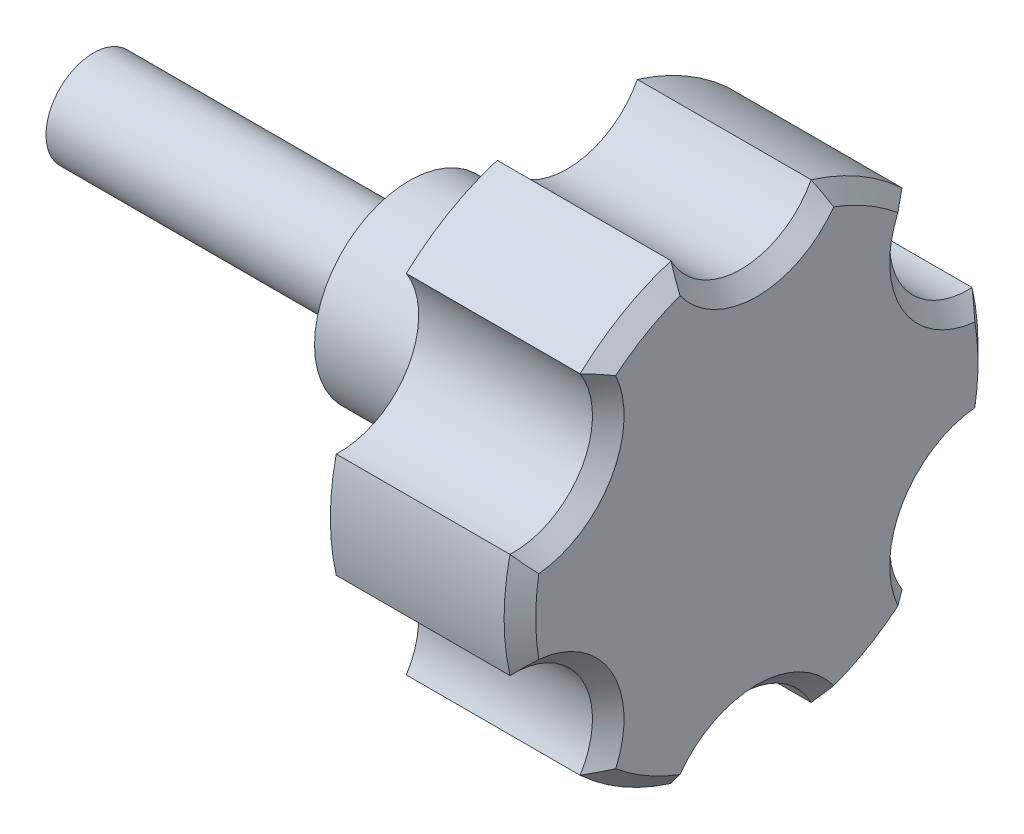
ISO-10303-21;
HEADER;
FILE_DESCRIPTION(('STEP AP214'),'2;1');
FILE_NAME('part.step','',(''),(''),'','','');
FILE_SCHEMA(('AUTOMOTIVE_DESIGN { 1 0 10303 214 1 1 1 1 }'));
ENDSEC;
DATA;
#1=APPLICATION_CONTEXT('core data for automotive mechanical design processes');
#2=APPLICATION_PROTOCOL_DEFINITION('international standard','automotive_design',2000,#1);
#3=PRODUCT_CONTEXT('',#1,'mechanical');
#4=PRODUCT('Part','Part','',(#3));
#5=PRODUCT_RELATED_PRODUCT_CATEGORY('part','',(#4));
#6=PRODUCT_DEFINITION_FORMATION('','',#4);
#7=PRODUCT_DEFINITION_CONTEXT('part definition',#1,'design');
#8=PRODUCT_DEFINITION('design','',#6,#7);
#9=PRODUCT_DEFINITION_SHAPE('','',#8);
#10=(LENGTH_UNIT() NAMED_UNIT(*) SI_UNIT(.MILLI.,.METRE.));
#11=(NAMED_UNIT(*) PLANE_ANGLE_UNIT() SI_UNIT($,.RADIAN.));
#12=(NAMED_UNIT(*) SI_UNIT($,.STERADIAN.) SOLID_ANGLE_UNIT());
#13=UNCERTAINTY_MEASURE_WITH_UNIT(LENGTH_MEASURE(1.E-05),#10,'distance_accuracy_value','');
#14=(GEOMETRIC_REPRESENTATION_CONTEXT(3) GLOBAL_UNCERTAINTY_ASSIGNED_CONTEXT((#13)) GLOBAL_UNIT_ASSIGNED_CONTEXT((#10,
#11,#12)) REPRESENTATION_CONTEXT('',''));
#15=CARTESIAN_POINT('',(0.,0.,0.));
#16=DIRECTION('',(0.,0.,1.));
#17=DIRECTION('',(1.,0.,0.));
#18=AXIS2_PLACEMENT_3D('',#15,#16,#17);
#19=CARTESIAN_POINT('',(-15.9389261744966,0.,0.));
#20=DIRECTION('',(-1.,0.,0.));
#21=DIRECTION('',(0.,0.,1.));
#22=AXIS2_PLACEMENT_3D('',#19,#20,#21);
#23=CYLINDRICAL_SURFACE('',#22,15.);
#24=DIRECTION('',(1.,0.,0.));
#25=VECTOR('',#24,1.);
#26=CARTESIAN_POINT('',(21.,3.32258184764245,-14.627386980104));
#27=LINE('',#26,#25);
#28=CARTESIAN_POINT('',(30.,3.32258184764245,-14.627386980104));
#29=VERTEX_POINT('',#28);
#30=CARTESIAN_POINT('',(41.,3.32258184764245,-14.627386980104));
#31=VERTEX_POINT('',#30);
#32=EDGE_CURVE('E161',#29,#31,#27,.T.);
#33=ORIENTED_EDGE('',*,*,#32,.T.);
#34=CARTESIAN_POINT('',(41.,0.,0.));
#35=DIRECTION('',(-1.,0.,0.));
#36=DIRECTION('',(0.,0.,1.));
#37=AXIS2_PLACEMENT_3D('',#34,#35,#36);
#38=CIRCLE('',#37,15.);
#39=CARTESIAN_POINT('',(41.,-3.32258184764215,-14.6273869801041));
#40=VERTEX_POINT('',#39);
#41=EDGE_CURVE('E11',#31,#40,#38,.T.);
#42=ORIENTED_EDGE('',*,*,#41,.T.);
#43=DIRECTION('',(1.,0.,0.));
#44=VECTOR('',#43,1.);
#45=CARTESIAN_POINT('',(21.,-3.32258184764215,-14.6273869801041));
#46=LINE('',#45,#44);
#47=CARTESIAN_POINT('',(30.,-3.32258184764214,-14.6273869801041));
#48=VERTEX_POINT('',#47);
#49=EDGE_CURVE('E220',#40,#48,#46,.F.);
#50=ORIENTED_EDGE('',*,*,#49,.T.);
#51=CARTESIAN_POINT('',(30.,0.,0.));
#52=DIRECTION('',(-1.,0.,0.));
#53=DIRECTION('',(0.,0.,1.));
#54=AXIS2_PLACEMENT_3D('',#51,#52,#53);
#55=CIRCLE('',#54,15.);
#56=EDGE_CURVE('E172',#29,#48,#55,.T.);
#57=ORIENTED_EDGE('',*,*,#56,.F.);
#58=EDGE_LOOP('',(#33,#42,#50,#57));
#59=FACE_BOUND('',#58,.T.);
#60=ADVANCED_FACE('F28',(#59),#23,.T.);
#61=DIRECTION('',(1.,0.,0.));
#62=VECTOR('',#61,1.);
#63=CARTESIAN_POINT('',(21.,-11.0063977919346,-10.1911337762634));
#64=LINE('',#63,#62);
#65=CARTESIAN_POINT('',(30.,-11.0063977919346,-10.1911337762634));
#66=VERTEX_POINT('',#65);
#67=CARTESIAN_POINT('',(41.,-11.0063977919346,-10.1911337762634));
#68=VERTEX_POINT('',#67);
#69=EDGE_CURVE('E214',#66,#68,#64,.T.);
#70=ORIENTED_EDGE('',*,*,#69,.T.);
#71=CARTESIAN_POINT('',(41.,0.,0.));
#72=DIRECTION('',(-1.,0.,0.));
#73=DIRECTION('',(0.,0.,1.));
#74=AXIS2_PLACEMENT_3D('',#71,#72,#73);
#75=CIRCLE('',#74,15.);
#76=CARTESIAN_POINT('',(41.,-14.328979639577,-4.43625320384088));
#77=VERTEX_POINT('',#76);
#78=EDGE_CURVE('E410',#68,#77,#75,.T.);
#79=ORIENTED_EDGE('',*,*,#78,.T.);
#80=DIRECTION('',(1.,0.,0.));
#81=VECTOR('',#80,1.);
#82=CARTESIAN_POINT('',(21.,-14.328979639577,-4.43625320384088));
#83=LINE('',#82,#81);
#84=CARTESIAN_POINT('',(30.,-14.328979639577,-4.43625320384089));
#85=VERTEX_POINT('',#84);
#86=EDGE_CURVE('E212',#77,#85,#83,.F.);
#87=ORIENTED_EDGE('',*,*,#86,.T.);
#88=EDGE_CURVE('E178',#66,#85,#55,.T.);
#89=ORIENTED_EDGE('',*,*,#88,.F.);
#90=EDGE_LOOP('',(#70,#79,#87,#89));
#91=FACE_BOUND('',#90,.T.);
#92=ADVANCED_FACE('F347',(#91),#23,.T.);
#93=DIRECTION('',(1.,0.,0.));
#94=VECTOR('',#93,1.);
#95=CARTESIAN_POINT('',(21.,-14.328979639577,4.43625320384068));
#96=LINE('',#95,#94);
#97=CARTESIAN_POINT('',(30.,-14.328979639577,4.43625320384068));
#98=VERTEX_POINT('',#97);
#99=CARTESIAN_POINT('',(41.,-14.328979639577,4.43625320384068));
#100=VERTEX_POINT('',#99);
#101=EDGE_CURVE('E206',#98,#100,#96,.T.);
#102=ORIENTED_EDGE('',*,*,#101,.T.);
#103=CARTESIAN_POINT('',(41.,0.,0.));
#104=DIRECTION('',(-1.,0.,0.));
#105=DIRECTION('',(0.,0.,1.));
#106=AXIS2_PLACEMENT_3D('',#103,#104,#105);
#107=CIRCLE('',#106,15.);
#108=CARTESIAN_POINT('',(41.,-11.0063977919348,10.1911337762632));
#109=VERTEX_POINT('',#108);
#110=EDGE_CURVE('E406',#100,#109,#107,.T.);
#111=ORIENTED_EDGE('',*,*,#110,.T.);
#112=DIRECTION('',(1.,0.,0.));
#113=VECTOR('',#112,1.);
#114=CARTESIAN_POINT('',(21.,-11.0063977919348,10.1911337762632));
#115=LINE('',#114,#113);
#116=CARTESIAN_POINT('',(30.,-11.0063977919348,10.1911337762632));
#117=VERTEX_POINT('',#116);
#118=EDGE_CURVE('E204',#109,#117,#115,.F.);
#119=ORIENTED_EDGE('',*,*,#118,.T.);
#120=EDGE_CURVE('E185',#98,#117,#55,.T.);
#121=ORIENTED_EDGE('',*,*,#120,.F.);
#122=EDGE_LOOP('',(#102,#111,#119,#121));
#123=FACE_BOUND('',#122,.T.);
#124=ADVANCED_FACE('F353',(#123),#23,.T.);
#125=DIRECTION('',(1.,0.,0.));
#126=VECTOR('',#125,1.);
#127=CARTESIAN_POINT('',(21.,-3.32258184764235,14.6273869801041));
#128=LINE('',#127,#126);
#129=CARTESIAN_POINT('',(30.,-3.32258184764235,14.6273869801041));
#130=VERTEX_POINT('',#129);
#131=CARTESIAN_POINT('',(41.,-3.32258184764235,14.6273869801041));
#132=VERTEX_POINT('',#131);
#133=EDGE_CURVE('E198',#130,#132,#128,.T.);
#134=ORIENTED_EDGE('',*,*,#133,.T.);
#135=CARTESIAN_POINT('',(41.,0.,0.));
#136=DIRECTION('',(-1.,0.,0.));
#137=DIRECTION('',(0.,0.,1.));
#138=AXIS2_PLACEMENT_3D('',#135,#136,#137);
#139=CIRCLE('',#138,15.);
#140=CARTESIAN_POINT('',(41.,3.32258184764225,14.6273869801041));
#141=VERTEX_POINT('',#140);
#142=EDGE_CURVE('E399',#132,#141,#139,.T.);
#143=ORIENTED_EDGE('',*,*,#142,.T.);
#144=DIRECTION('',(1.,0.,0.));
#145=VECTOR('',#144,1.);
#146=CARTESIAN_POINT('',(21.,3.32258184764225,14.6273869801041));
#147=LINE('',#146,#145);
#148=CARTESIAN_POINT('',(30.,3.32258184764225,14.6273869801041));
#149=VERTEX_POINT('',#148);
#150=EDGE_CURVE('E196',#141,#149,#147,.F.);
#151=ORIENTED_EDGE('',*,*,#150,.T.);
#152=EDGE_CURVE('E180',#130,#149,#55,.T.);
#153=ORIENTED_EDGE('',*,*,#152,.F.);
#154=EDGE_LOOP('',(#134,#143,#151,#153));
#155=FACE_BOUND('',#154,.T.);
#156=ADVANCED_FACE('F369',(#155),#23,.T.);
#157=DIRECTION('',(1.,0.,0.));
#158=VECTOR('',#157,1.);
#159=CARTESIAN_POINT('',(21.,11.0063977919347,10.1911337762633));
#160=LINE('',#159,#158);
#161=CARTESIAN_POINT('',(30.,11.0063977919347,10.1911337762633));
#162=VERTEX_POINT('',#161);
#163=CARTESIAN_POINT('',(41.,11.0063977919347,10.1911337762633));
#164=VERTEX_POINT('',#163);
#165=EDGE_CURVE('E191',#162,#164,#160,.T.);
#166=ORIENTED_EDGE('',*,*,#165,.T.);
#167=CARTESIAN_POINT('',(41.,0.,0.));
#168=DIRECTION('',(-1.,0.,0.));
#169=DIRECTION('',(0.,0.,1.));
#170=AXIS2_PLACEMENT_3D('',#167,#168,#169);
#171=CIRCLE('',#170,15.);
#172=CARTESIAN_POINT('',(41.,14.328979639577,4.43625320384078));
#173=VERTEX_POINT('',#172);
#174=EDGE_CURVE('E380',#164,#173,#171,.T.);
#175=ORIENTED_EDGE('',*,*,#174,.T.);
#176=DIRECTION('',(1.,0.,0.));
#177=VECTOR('',#176,1.);
#178=CARTESIAN_POINT('',(21.,14.328979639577,4.43625320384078));
#179=LINE('',#178,#177);
#180=CARTESIAN_POINT('',(30.,14.328979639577,4.43625320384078));
#181=VERTEX_POINT('',#180);
#182=EDGE_CURVE('E187',#173,#181,#179,.F.);
#183=ORIENTED_EDGE('',*,*,#182,.T.);
#184=EDGE_CURVE('E174',#162,#181,#55,.T.);
#185=ORIENTED_EDGE('',*,*,#184,.F.);
#186=EDGE_LOOP('',(#166,#175,#183,#185));
#187=FACE_BOUND('',#186,.T.);
#188=ADVANCED_FACE('F359',(#187),#23,.T.);
#189=CARTESIAN_POINT('',(0.,0.,0.));
#190=DIRECTION('',(1.,0.,0.));
#191=DIRECTION('',(0.,0.,-1.));
#192=AXIS2_PLACEMENT_3D('',#189,#190,#191);
#193=PLANE('',#192);
#194=CARTESIAN_POINT('',(0.,0.,0.));
#195=DIRECTION('',(-1.,0.,0.));
#196=DIRECTION('',(0.,0.,1.));
#197=AXIS2_PLACEMENT_3D('',#194,#195,#196);
#198=CIRCLE('',#197,3.);
#199=CARTESIAN_POINT('',(0.,0.,3.));
#200=VERTEX_POINT('',#199);
#201=EDGE_CURVE('E439',#200,#200,#198,.T.);
#202=ORIENTED_EDGE('',*,*,#201,.T.);
#203=EDGE_LOOP('',(#202));
#204=FACE_BOUND('',#203,.T.);
#205=ADVANCED_FACE('F30',(#204),#193,.F.);
#206=CARTESIAN_POINT('',(-15.9389261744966,0.,0.));
#207=DIRECTION('',(-1.,0.,0.));
#208=DIRECTION('',(0.,0.,1.));
#209=AXIS2_PLACEMENT_3D('',#206,#207,#208);
#210=CYLINDRICAL_SURFACE('',#209,3.);
#211=ORIENTED_EDGE('',*,*,#201,.F.);
#212=EDGE_LOOP('',(#211));
#213=FACE_BOUND('',#212,.T.);
#214=CARTESIAN_POINT('',(20.,0.,0.));
#215=DIRECTION('',(-1.,0.,0.));
#216=DIRECTION('',(0.,0.,1.));
#217=AXIS2_PLACEMENT_3D('',#214,#215,#216);
#218=CIRCLE('',#217,3.);
#219=CARTESIAN_POINT('',(20.,0.,3.));
#220=VERTEX_POINT('',#219);
#221=EDGE_CURVE('E442',#220,#220,#218,.T.);
#222=ORIENTED_EDGE('',*,*,#221,.T.);
#223=EDGE_LOOP('',(#222));
#224=FACE_BOUND('',#223,.T.);
#225=ADVANCED_FACE('F375',(#213,#224),#210,.T.);
#226=CARTESIAN_POINT('',(20.,3.,0.));
#227=DIRECTION('',(1.,0.,0.));
#228=DIRECTION('',(0.,0.,-1.));
#229=AXIS2_PLACEMENT_3D('',#226,#227,#228);
#230=PLANE('',#229);
#231=ORIENTED_EDGE('',*,*,#221,.F.);
#232=EDGE_LOOP('',(#231));
#233=FACE_BOUND('',#232,.T.);
#234=CARTESIAN_POINT('',(20.,0.,0.));
#235=DIRECTION('',(-1.,0.,0.));
#236=DIRECTION('',(0.,0.,1.));
#237=AXIS2_PLACEMENT_3D('',#234,#235,#236);
#238=CIRCLE('',#237,6.);
#239=CARTESIAN_POINT('',(20.,0.,6.));
#240=VERTEX_POINT('',#239);
#241=EDGE_CURVE('E176',#240,#240,#238,.T.);
#242=ORIENTED_EDGE('',*,*,#241,.T.);
#243=EDGE_LOOP('',(#242));
#244=FACE_BOUND('',#243,.T.);
#245=ADVANCED_FACE('F448',(#233,#244),#230,.F.);
#246=CARTESIAN_POINT('',(-15.9389261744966,0.,0.));
#247=DIRECTION('',(-1.,0.,0.));
#248=DIRECTION('',(0.,0.,1.));
#249=AXIS2_PLACEMENT_3D('',#246,#247,#248);
#250=CYLINDRICAL_SURFACE('',#249,6.);
#251=ORIENTED_EDGE('',*,*,#241,.F.);
#252=EDGE_LOOP('',(#251));
#253=FACE_BOUND('',#252,.T.);
#254=CARTESIAN_POINT('',(30.,0.,0.));
#255=DIRECTION('',(-1.,0.,0.));
#256=DIRECTION('',(0.,0.,1.));
#257=AXIS2_PLACEMENT_3D('',#254,#255,#256);
#258=CIRCLE('',#257,6.);
#259=CARTESIAN_POINT('',(30.,0.,6.));
#260=VERTEX_POINT('',#259);
#261=EDGE_CURVE('E171',#260,#260,#258,.T.);
#262=ORIENTED_EDGE('',*,*,#261,.T.);
#263=EDGE_LOOP('',(#262));
#264=FACE_BOUND('',#263,.T.);
#265=ADVANCED_FACE('F366',(#253,#264),#250,.T.);
#266=CARTESIAN_POINT('',(30.,6.,0.));
#267=DIRECTION('',(1.,0.,0.));
#268=DIRECTION('',(0.,0.,-1.));
#269=AXIS2_PLACEMENT_3D('',#266,#267,#268);
#270=PLANE('',#269);
#271=ORIENTED_EDGE('',*,*,#261,.F.);
#272=EDGE_LOOP('',(#271));
#273=FACE_BOUND('',#272,.T.);
#274=CARTESIAN_POINT('',(30.,14.328979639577,-4.43625320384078));
#275=VERTEX_POINT('',#274);
#276=CARTESIAN_POINT('',(30.,11.0063977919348,-10.1911337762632));
#277=VERTEX_POINT('',#276);
#278=EDGE_CURVE('E154',#275,#277,#55,.T.);
#279=ORIENTED_EDGE('',*,*,#278,.T.);
#280=CARTESIAN_POINT('',(30.,8.31770895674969,-14.4066945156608));
#281=DIRECTION('',(1.,0.,0.));
#282=DIRECTION('',(0.,0.,-1.));
#283=AXIS2_PLACEMENT_3D('',#280,#281,#282);
#284=CIRCLE('',#283,5.);
#285=EDGE_CURVE('E156',#277,#29,#284,.T.);
#286=ORIENTED_EDGE('',*,*,#285,.T.);
#287=ORIENTED_EDGE('',*,*,#56,.T.);
#288=CARTESIAN_POINT('',(30.,-8.31770895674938,-14.406694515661));
#289=DIRECTION('',(1.,0.,0.));
#290=DIRECTION('',(0.,0.,-1.));
#291=AXIS2_PLACEMENT_3D('',#288,#289,#290);
#292=CIRCLE('',#291,5.);
#293=EDGE_CURVE('E217',#48,#66,#292,.T.);
#294=ORIENTED_EDGE('',*,*,#293,.T.);
#295=ORIENTED_EDGE('',*,*,#88,.T.);
#296=CARTESIAN_POINT('',(30.,-16.635417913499,-1.16164569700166E-13));
#297=DIRECTION('',(1.,0.,0.));
#298=DIRECTION('',(0.,0.,-1.));
#299=AXIS2_PLACEMENT_3D('',#296,#297,#298);
#300=CIRCLE('',#299,5.);
#301=EDGE_CURVE('E209',#85,#98,#300,.T.);
#302=ORIENTED_EDGE('',*,*,#301,.T.);
#303=ORIENTED_EDGE('',*,*,#120,.T.);
#304=CARTESIAN_POINT('',(30.,-8.31770895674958,14.4066945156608));
#305=DIRECTION('',(1.,0.,0.));
#306=DIRECTION('',(0.,0.,-1.));
#307=AXIS2_PLACEMENT_3D('',#304,#305,#306);
#308=CIRCLE('',#307,5.);
#309=EDGE_CURVE('E201',#117,#130,#308,.T.);
#310=ORIENTED_EDGE('',*,*,#309,.T.);
#311=ORIENTED_EDGE('',*,*,#152,.T.);
#312=CARTESIAN_POINT('',(30.,8.31770895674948,14.4066945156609));
#313=DIRECTION('',(1.,0.,0.));
#314=DIRECTION('',(0.,0.,-1.));
#315=AXIS2_PLACEMENT_3D('',#312,#313,#314);
#316=CIRCLE('',#315,5.);
#317=EDGE_CURVE('E194',#149,#162,#316,.T.);
#318=ORIENTED_EDGE('',*,*,#317,.T.);
#319=ORIENTED_EDGE('',*,*,#184,.T.);
#320=CARTESIAN_POINT('',(30.,16.635417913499,0.));
#321=DIRECTION('',(1.,0.,0.));
#322=DIRECTION('',(0.,0.,-1.));
#323=AXIS2_PLACEMENT_3D('',#320,#321,#322);
#324=CIRCLE('',#323,5.);
#325=EDGE_CURVE('E170',#181,#275,#324,.T.);
#326=ORIENTED_EDGE('',*,*,#325,.T.);
#327=EDGE_LOOP('',(#279,#286,#287,#294,#295,#302,#303,#310,#311,#318,#319,#326));
#328=FACE_BOUND('',#327,.T.);
#329=ADVANCED_FACE('F167',(#273,#328),#270,.F.);
#330=DIRECTION('',(1.,0.,0.));
#331=VECTOR('',#330,1.);
#332=CARTESIAN_POINT('',(21.,14.328979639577,-4.43625320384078));
#333=LINE('',#332,#331);
#334=CARTESIAN_POINT('',(41.,14.328979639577,-4.43625320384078));
#335=VERTEX_POINT('',#334);
#336=EDGE_CURVE('E181',#275,#335,#333,.T.);
#337=ORIENTED_EDGE('',*,*,#336,.T.);
#338=CARTESIAN_POINT('',(41.,0.,0.));
#339=DIRECTION('',(-1.,0.,0.));
#340=DIRECTION('',(0.,0.,1.));
#341=AXIS2_PLACEMENT_3D('',#338,#339,#340);
#342=CIRCLE('',#341,15.);
#343=CARTESIAN_POINT('',(41.,11.0063977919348,-10.1911337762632));
#344=VERTEX_POINT('',#343);
#345=EDGE_CURVE('E50',#335,#344,#342,.T.);
#346=ORIENTED_EDGE('',*,*,#345,.T.);
#347=DIRECTION('',(1.,0.,0.));
#348=VECTOR('',#347,1.);
#349=CARTESIAN_POINT('',(21.,11.0063977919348,-10.1911337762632));
#350=LINE('',#349,#348);
#351=EDGE_CURVE('E150',#344,#277,#350,.F.);
#352=ORIENTED_EDGE('',*,*,#351,.T.);
#353=ORIENTED_EDGE('',*,*,#278,.F.);
#354=EDGE_LOOP('',(#337,#346,#352,#353));
#355=FACE_BOUND('',#354,.T.);
#356=ADVANCED_FACE('F152',(#355),#23,.T.);
#357=CARTESIAN_POINT('',(42.,15.,0.));
#358=DIRECTION('',(-1.,0.,0.));
#359=DIRECTION('',(0.,0.,1.));
#360=AXIS2_PLACEMENT_3D('',#357,#358,#359);
#361=PLANE('',#360);
#362=CARTESIAN_POINT('',(42.,0.,0.));
#363=DIRECTION('',(-1.,0.,0.));
#364=DIRECTION('',(0.,0.,1.));
#365=AXIS2_PLACEMENT_3D('',#362,#363,#364);
#366=CIRCLE('',#365,14.);
#367=CARTESIAN_POINT('',(42.,-13.1267255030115,-4.86714264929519));
#368=VERTEX_POINT('',#367);
#369=CARTESIAN_POINT('',(42.,-10.7784319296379,-8.93450642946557));
#370=VERTEX_POINT('',#369);
#371=EDGE_CURVE('E418',#368,#370,#366,.F.);
#372=ORIENTED_EDGE('',*,*,#371,.T.);
#373=CARTESIAN_POINT('',(42.,-8.31770895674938,-14.406694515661));
#374=DIRECTION('',(-1.,0.,0.));
#375=DIRECTION('',(0.,0.,1.));
#376=AXIS2_PLACEMENT_3D('',#373,#374,#375);
#377=CIRCLE('',#376,6.00000000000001);
#378=CARTESIAN_POINT('',(42.,-2.34829357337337,-13.8016490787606));
#379=VERTEX_POINT('',#378);
#380=EDGE_CURVE('E415',#370,#379,#377,.T.);
#381=ORIENTED_EDGE('',*,*,#380,.T.);
#382=CARTESIAN_POINT('',(42.,0.,0.));
#383=DIRECTION('',(-1.,0.,0.));
#384=DIRECTION('',(0.,0.,1.));
#385=AXIS2_PLACEMENT_3D('',#382,#383,#384);
#386=CIRCLE('',#385,14.);
#387=CARTESIAN_POINT('',(42.,2.34829357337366,-13.8016490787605));
#388=VERTEX_POINT('',#387);
#389=EDGE_CURVE('E437',#379,#388,#386,.F.);
#390=ORIENTED_EDGE('',*,*,#389,.T.);
#391=CARTESIAN_POINT('',(42.,8.31770895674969,-14.4066945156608));
#392=DIRECTION('',(-1.,0.,0.));
#393=DIRECTION('',(0.,0.,1.));
#394=AXIS2_PLACEMENT_3D('',#391,#392,#393);
#395=CIRCLE('',#394,6.00000000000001);
#396=CARTESIAN_POINT('',(42.,10.7784319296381,-8.93450642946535));
#397=VERTEX_POINT('',#396);
#398=EDGE_CURVE('E435',#388,#397,#395,.T.);
#399=ORIENTED_EDGE('',*,*,#398,.T.);
#400=CARTESIAN_POINT('',(42.,0.,0.));
#401=DIRECTION('',(-1.,0.,0.));
#402=DIRECTION('',(0.,0.,1.));
#403=AXIS2_PLACEMENT_3D('',#400,#401,#402);
#404=CIRCLE('',#403,14.);
#405=CARTESIAN_POINT('',(42.,13.1267255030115,-4.86714264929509));
#406=VERTEX_POINT('',#405);
#407=EDGE_CURVE('E433',#397,#406,#404,.F.);
#408=ORIENTED_EDGE('',*,*,#407,.T.);
#409=CARTESIAN_POINT('',(42.,16.635417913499,0.));
#410=DIRECTION('',(-1.,0.,0.));
#411=DIRECTION('',(0.,0.,1.));
#412=AXIS2_PLACEMENT_3D('',#409,#410,#411);
#413=CIRCLE('',#412,6.00000000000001);
#414=CARTESIAN_POINT('',(42.,13.1267255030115,4.86714264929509));
#415=VERTEX_POINT('',#414);
#416=EDGE_CURVE('E431',#406,#415,#413,.T.);
#417=ORIENTED_EDGE('',*,*,#416,.T.);
#418=CARTESIAN_POINT('',(42.,0.,0.));
#419=DIRECTION('',(-1.,0.,0.));
#420=DIRECTION('',(0.,0.,1.));
#421=AXIS2_PLACEMENT_3D('',#418,#419,#420);
#422=CIRCLE('',#421,14.);
#423=CARTESIAN_POINT('',(42.,10.778431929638,8.9345064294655));
#424=VERTEX_POINT('',#423);
#425=EDGE_CURVE('E429',#415,#424,#422,.F.);
#426=ORIENTED_EDGE('',*,*,#425,.T.);
#427=CARTESIAN_POINT('',(42.,8.31770895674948,14.4066945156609));
#428=DIRECTION('',(-1.,0.,0.));
#429=DIRECTION('',(0.,0.,1.));
#430=AXIS2_PLACEMENT_3D('',#427,#428,#429);
#431=CIRCLE('',#430,6.00000000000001);
#432=CARTESIAN_POINT('',(42.,2.34829357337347,13.8016490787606));
#433=VERTEX_POINT('',#432);
#434=EDGE_CURVE('E390',#424,#433,#431,.T.);
#435=ORIENTED_EDGE('',*,*,#434,.T.);
#436=CARTESIAN_POINT('',(42.,0.,0.));
#437=DIRECTION('',(-1.,0.,0.));
#438=DIRECTION('',(0.,0.,1.));
#439=AXIS2_PLACEMENT_3D('',#436,#437,#438);
#440=CIRCLE('',#439,14.);
#441=CARTESIAN_POINT('',(42.,-2.34829357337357,13.8016490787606));
#442=VERTEX_POINT('',#441);
#443=EDGE_CURVE('E426',#433,#442,#440,.F.);
#444=ORIENTED_EDGE('',*,*,#443,.T.);
#445=CARTESIAN_POINT('',(42.,-8.31770895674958,14.4066945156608));
#446=DIRECTION('',(-1.,0.,0.));
#447=DIRECTION('',(0.,0.,1.));
#448=AXIS2_PLACEMENT_3D('',#445,#446,#447);
#449=CIRCLE('',#448,6.00000000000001);
#450=CARTESIAN_POINT('',(42.,-10.778431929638,8.93450642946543));
#451=VERTEX_POINT('',#450);
#452=EDGE_CURVE('E424',#442,#451,#449,.T.);
#453=ORIENTED_EDGE('',*,*,#452,.T.);
#454=CARTESIAN_POINT('',(42.,0.,0.));
#455=DIRECTION('',(-1.,0.,0.));
#456=DIRECTION('',(0.,0.,1.));
#457=AXIS2_PLACEMENT_3D('',#454,#455,#456);
#458=CIRCLE('',#457,14.);
#459=CARTESIAN_POINT('',(42.,-13.1267255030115,4.867142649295));
#460=VERTEX_POINT('',#459);
#461=EDGE_CURVE('E422',#451,#460,#458,.F.);
#462=ORIENTED_EDGE('',*,*,#461,.T.);
#463=CARTESIAN_POINT('',(42.,-16.635417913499,-1.16164569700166E-13));
#464=DIRECTION('',(-1.,0.,0.));
#465=DIRECTION('',(0.,0.,1.));
#466=AXIS2_PLACEMENT_3D('',#463,#464,#465);
#467=CIRCLE('',#466,6.00000000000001);
#468=EDGE_CURVE('E420',#460,#368,#467,.T.);
#469=ORIENTED_EDGE('',*,*,#468,.T.);
#470=EDGE_LOOP('',(#372,#381,#390,#399,#408,#417,#426,#435,#444,#453,#462,#469));
#471=FACE_BOUND('',#470,.T.);
#472=ADVANCED_FACE('F358',(#471),#361,.F.);
#473=CARTESIAN_POINT('',(0.,16.635417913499,0.));
#474=DIRECTION('',(1.,0.,0.));
#475=DIRECTION('',(0.,0.,-1.));
#476=AXIS2_PLACEMENT_3D('',#473,#474,#475);
#477=CYLINDRICAL_SURFACE('',#476,5.);
#478=ORIENTED_EDGE('',*,*,#182,.F.);
#479=CARTESIAN_POINT('',(41.,16.635417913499,0.));
#480=DIRECTION('',(-1.,0.,0.));
#481=DIRECTION('',(0.,0.,1.));
#482=AXIS2_PLACEMENT_3D('',#479,#480,#481);
#483=CIRCLE('',#482,5.);
#484=EDGE_CURVE('E396',#173,#335,#483,.F.);
#485=ORIENTED_EDGE('',*,*,#484,.T.);
#486=ORIENTED_EDGE('',*,*,#336,.F.);
#487=ORIENTED_EDGE('',*,*,#325,.F.);
#488=EDGE_LOOP('',(#478,#485,#486,#487));
#489=FACE_BOUND('',#488,.T.);
#490=ADVANCED_FACE('F364',(#489),#477,.F.);
#491=CARTESIAN_POINT('',(0.,8.31770895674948,14.4066945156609));
#492=DIRECTION('',(1.,0.,0.));
#493=DIRECTION('',(0.,0.,-1.));
#494=AXIS2_PLACEMENT_3D('',#491,#492,#493);
#495=CYLINDRICAL_SURFACE('',#494,5.);
#496=ORIENTED_EDGE('',*,*,#150,.F.);
#497=CARTESIAN_POINT('',(41.,8.31770895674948,14.4066945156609));
#498=DIRECTION('',(-1.,0.,0.));
#499=DIRECTION('',(0.,0.,1.));
#500=AXIS2_PLACEMENT_3D('',#497,#498,#499);
#501=CIRCLE('',#500,5.);
#502=EDGE_CURVE('E389',#141,#164,#501,.F.);
#503=ORIENTED_EDGE('',*,*,#502,.T.);
#504=ORIENTED_EDGE('',*,*,#165,.F.);
#505=ORIENTED_EDGE('',*,*,#317,.F.);
#506=EDGE_LOOP('',(#496,#503,#504,#505));
#507=FACE_BOUND('',#506,.T.);
#508=ADVANCED_FACE('F530',(#507),#495,.F.);
#509=CARTESIAN_POINT('',(0.,-8.31770895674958,14.4066945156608));
#510=DIRECTION('',(1.,0.,0.));
#511=DIRECTION('',(0.,0.,-1.));
#512=AXIS2_PLACEMENT_3D('',#509,#510,#511);
#513=CYLINDRICAL_SURFACE('',#512,5.);
#514=ORIENTED_EDGE('',*,*,#118,.F.);
#515=CARTESIAN_POINT('',(41.,-8.31770895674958,14.4066945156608));
#516=DIRECTION('',(-1.,0.,0.));
#517=DIRECTION('',(0.,0.,1.));
#518=AXIS2_PLACEMENT_3D('',#515,#516,#517);
#519=CIRCLE('',#518,5.);
#520=EDGE_CURVE('E404',#109,#132,#519,.F.);
#521=ORIENTED_EDGE('',*,*,#520,.T.);
#522=ORIENTED_EDGE('',*,*,#133,.F.);
#523=ORIENTED_EDGE('',*,*,#309,.F.);
#524=EDGE_LOOP('',(#514,#521,#522,#523));
#525=FACE_BOUND('',#524,.T.);
#526=ADVANCED_FACE('F539',(#525),#513,.F.);
#527=CARTESIAN_POINT('',(0.,-16.635417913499,-1.16164569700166E-13));
#528=DIRECTION('',(1.,0.,0.));
#529=DIRECTION('',(0.,0.,-1.));
#530=AXIS2_PLACEMENT_3D('',#527,#528,#529);
#531=CYLINDRICAL_SURFACE('',#530,5.);
#532=ORIENTED_EDGE('',*,*,#86,.F.);
#533=CARTESIAN_POINT('',(41.,-16.635417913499,-1.16164569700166E-13));
#534=DIRECTION('',(-1.,0.,0.));
#535=DIRECTION('',(0.,0.,1.));
#536=AXIS2_PLACEMENT_3D('',#533,#534,#535);
#537=CIRCLE('',#536,5.);
#538=EDGE_CURVE('E408',#77,#100,#537,.F.);
#539=ORIENTED_EDGE('',*,*,#538,.T.);
#540=ORIENTED_EDGE('',*,*,#101,.F.);
#541=ORIENTED_EDGE('',*,*,#301,.F.);
#542=EDGE_LOOP('',(#532,#539,#540,#541));
#543=FACE_BOUND('',#542,.T.);
#544=ADVANCED_FACE('F548',(#543),#531,.F.);
#545=CARTESIAN_POINT('',(0.,-8.31770895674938,-14.406694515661));
#546=DIRECTION('',(1.,0.,0.));
#547=DIRECTION('',(0.,0.,-1.));
#548=AXIS2_PLACEMENT_3D('',#545,#546,#547);
#549=CYLINDRICAL_SURFACE('',#548,5.);
#550=ORIENTED_EDGE('',*,*,#49,.F.);
#551=CARTESIAN_POINT('',(41.,-8.31770895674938,-14.406694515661));
#552=DIRECTION('',(-1.,0.,0.));
#553=DIRECTION('',(0.,0.,1.));
#554=AXIS2_PLACEMENT_3D('',#551,#552,#553);
#555=CIRCLE('',#554,5.);
#556=EDGE_CURVE('E412',#40,#68,#555,.F.);
#557=ORIENTED_EDGE('',*,*,#556,.T.);
#558=ORIENTED_EDGE('',*,*,#69,.F.);
#559=ORIENTED_EDGE('',*,*,#293,.F.);
#560=EDGE_LOOP('',(#550,#557,#558,#559));
#561=FACE_BOUND('',#560,.T.);
#562=ADVANCED_FACE('F558',(#561),#549,.F.);
#563=CARTESIAN_POINT('',(0.,8.31770895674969,-14.4066945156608));
#564=DIRECTION('',(1.,0.,0.));
#565=DIRECTION('',(0.,0.,-1.));
#566=AXIS2_PLACEMENT_3D('',#563,#564,#565);
#567=CYLINDRICAL_SURFACE('',#566,5.);
#568=ORIENTED_EDGE('',*,*,#351,.F.);
#569=CARTESIAN_POINT('',(41.,8.31770895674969,-14.4066945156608));
#570=DIRECTION('',(-1.,0.,0.));
#571=DIRECTION('',(0.,0.,1.));
#572=AXIS2_PLACEMENT_3D('',#569,#570,#571);
#573=CIRCLE('',#572,5.);
#574=EDGE_CURVE('E36',#344,#31,#573,.F.);
#575=ORIENTED_EDGE('',*,*,#574,.T.);
#576=ORIENTED_EDGE('',*,*,#32,.F.);
#577=ORIENTED_EDGE('',*,*,#285,.F.);
#578=EDGE_LOOP('',(#568,#575,#576,#577));
#579=FACE_BOUND('',#578,.T.);
#580=ADVANCED_FACE('F160',(#579),#567,.F.);
#581=CARTESIAN_POINT('',(42.,8.31770895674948,14.4066945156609));
#582=DIRECTION('',(1.,0.,0.));
#583=DIRECTION('',(0.,0.,-1.));
#584=AXIS2_PLACEMENT_3D('',#581,#582,#583);
#585=CONICAL_SURFACE('',#584,6.00000000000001,0.785398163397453);
#586=CARTESIAN_POINT('',(41.,11.0063977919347,10.1911337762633));
#587=CARTESIAN_POINT('',(41.0823455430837,10.992694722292,10.0847295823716));
#588=CARTESIAN_POINT('',(41.1649849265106,10.9775649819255,9.97874115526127));
#589=CARTESIAN_POINT('',(41.3307532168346,10.9446149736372,9.76763810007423));
#590=CARTESIAN_POINT('',(41.4138819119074,10.9267957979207,9.66252313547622));
#591=CARTESIAN_POINT('',(41.5805924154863,10.8886195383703,9.45312943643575));
#592=CARTESIAN_POINT('',(41.6641741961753,10.8682626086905,9.34885065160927));
#593=CARTESIAN_POINT('',(41.831778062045,10.8251291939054,9.14107876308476));
#594=CARTESIAN_POINT('',(41.9158003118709,10.8023517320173,9.03758599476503));
#595=CARTESIAN_POINT('',(42.,10.778431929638,8.9345064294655));
#596=B_SPLINE_CURVE_WITH_KNOTS('',3,(#586,#587,#588,#589,#590,#591,#592,#593,#594,#595),
.UNSPECIFIED.,.F.,.F.,(4,2,2,2,4),(0.,0.405712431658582,0.81126054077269,1.21678402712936,
1.62247178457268),.UNSPECIFIED.);
#597=EDGE_CURVE('E230',#164,#424,#596,.T.);
#598=ORIENTED_EDGE('',*,*,#597,.F.);
#599=ORIENTED_EDGE('',*,*,#502,.F.);
#600=CARTESIAN_POINT('',(41.,3.32258184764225,14.6273869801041));
#601=CARTESIAN_POINT('',(41.0823455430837,3.2372846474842,14.5623176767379));
#602=CARTESIAN_POINT('',(41.1649849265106,3.15306084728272,14.4962207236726));
#603=CARTESIAN_POINT('',(41.3307532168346,2.9867152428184,14.3621336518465));
#604=CARTESIAN_POINT('',(41.4138819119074,2.90459260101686,14.2941443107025));
#605=CARTESIAN_POINT('',(41.5805924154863,2.74234046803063,14.1563858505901));
#606=CARTESIAN_POINT('',(41.6641741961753,2.66221085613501,14.0866168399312));
#607=CARTESIAN_POINT('',(41.831778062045,2.50384182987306,13.9453762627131));
#608=CARTESIAN_POINT('',(41.9158003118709,2.42560319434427,13.8739040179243));
#609=CARTESIAN_POINT('',(42.,2.34829357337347,13.8016490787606));
#610=B_SPLINE_CURVE_WITH_KNOTS('',3,(#600,#601,#602,#603,#604,#605,#606,#607,#608,#609),
.UNSPECIFIED.,.F.,.F.,(4,2,2,2,4),(0.,0.405712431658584,0.81126054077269,1.21678402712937,
1.62247178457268),.UNSPECIFIED.);
#611=EDGE_CURVE('E157',#433,#141,#610,.F.);
#612=ORIENTED_EDGE('',*,*,#611,.F.);
#613=ORIENTED_EDGE('',*,*,#434,.F.);
#614=EDGE_LOOP('',(#598,#599,#612,#613));
#615=FACE_BOUND('',#614,.T.);
#616=ADVANCED_FACE('F236',(#615),#585,.F.);
#617=CARTESIAN_POINT('',(41.,0.,0.));
#618=DIRECTION('',(-1.,0.,0.));
#619=DIRECTION('',(0.,0.,1.));
#620=AXIS2_PLACEMENT_3D('',#617,#618,#619);
#621=CONICAL_SURFACE('',#620,15.,0.785398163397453);
#622=ORIENTED_EDGE('',*,*,#611,.T.);
#623=ORIENTED_EDGE('',*,*,#142,.F.);
#624=CARTESIAN_POINT('',(41.,-3.32258184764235,14.6273869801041));
#625=CARTESIAN_POINT('',(41.0823455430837,-3.2372846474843,14.5623176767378));
#626=CARTESIAN_POINT('',(41.1649849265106,-3.15306084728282,14.4962207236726));
#627=CARTESIAN_POINT('',(41.3307532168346,-2.9867152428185,14.3621336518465));
#628=CARTESIAN_POINT('',(41.4138819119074,-2.90459260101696,14.2941443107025));
#629=CARTESIAN_POINT('',(41.5805924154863,-2.74234046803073,14.1563858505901));
#630=CARTESIAN_POINT('',(41.6641741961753,-2.66221085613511,14.0866168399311));
#631=CARTESIAN_POINT('',(41.831778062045,-2.50384182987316,13.945376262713));
#632=CARTESIAN_POINT('',(41.9158003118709,-2.42560319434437,13.8739040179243));
#633=CARTESIAN_POINT('',(42.,-2.34829357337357,13.8016490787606));
#634=B_SPLINE_CURVE_WITH_KNOTS('',3,(#624,#625,#626,#627,#628,#629,#630,#631,#632,#633),
.UNSPECIFIED.,.F.,.F.,(4,2,2,2,4),(0.,0.405712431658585,0.811260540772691,1.21678402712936,
1.62247178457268),.UNSPECIFIED.);
#635=EDGE_CURVE('E247',#442,#132,#634,.F.);
#636=ORIENTED_EDGE('',*,*,#635,.F.);
#637=ORIENTED_EDGE('',*,*,#443,.F.);
#638=EDGE_LOOP('',(#622,#623,#636,#637));
#639=FACE_BOUND('',#638,.T.);
#640=ADVANCED_FACE('F239',(#639),#621,.T.);
#641=CARTESIAN_POINT('',(41.,0.,0.));
#642=DIRECTION('',(-1.,0.,0.));
#643=DIRECTION('',(0.,0.,1.));
#644=AXIS2_PLACEMENT_3D('',#641,#642,#643);
#645=CONICAL_SURFACE('',#644,15.,0.785398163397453);
#646=ORIENTED_EDGE('',*,*,#597,.T.);
#647=ORIENTED_EDGE('',*,*,#425,.F.);
#648=CARTESIAN_POINT('',(41.,14.328979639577,4.43625320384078));
#649=CARTESIAN_POINT('',(41.0823455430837,14.2299793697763,4.47758809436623));
#650=CARTESIAN_POINT('',(41.1649849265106,14.1306258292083,4.51747956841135));
#651=CARTESIAN_POINT('',(41.3307532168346,13.9313302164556,4.59449555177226));
#652=CARTESIAN_POINT('',(41.4138819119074,13.8313883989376,4.6316211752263));
#653=CARTESIAN_POINT('',(41.5805924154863,13.630960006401,4.7032564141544));
#654=CARTESIAN_POINT('',(41.6641741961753,13.5304734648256,4.73776618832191));
#655=CARTESIAN_POINT('',(41.831778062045,13.3289710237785,4.80429749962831));
#656=CARTESIAN_POINT('',(41.9158003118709,13.2279549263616,4.83631802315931));
#657=CARTESIAN_POINT('',(42.,13.1267255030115,4.86714264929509));
#658=B_SPLINE_CURVE_WITH_KNOTS('',3,(#648,#649,#650,#651,#652,#653,#654,#655,#656,#657),
.UNSPECIFIED.,.F.,.F.,(4,2,2,2,4),(0.,0.405712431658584,0.811260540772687,1.21678402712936,
1.62247178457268),.UNSPECIFIED.);
#659=EDGE_CURVE('E253',#173,#415,#658,.T.);
#660=ORIENTED_EDGE('',*,*,#659,.F.);
#661=ORIENTED_EDGE('',*,*,#174,.F.);
#662=EDGE_LOOP('',(#646,#647,#660,#661));
#663=FACE_BOUND('',#662,.T.);
#664=ADVANCED_FACE('F242',(#663),#645,.T.);
#665=CARTESIAN_POINT('',(42.,-8.31770895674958,14.4066945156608));
#666=DIRECTION('',(1.,0.,0.));
#667=DIRECTION('',(0.,0.,-1.));
#668=AXIS2_PLACEMENT_3D('',#665,#666,#667);
#669=CONICAL_SURFACE('',#668,6.00000000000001,0.785398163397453);
#670=ORIENTED_EDGE('',*,*,#635,.T.);
#671=ORIENTED_EDGE('',*,*,#520,.F.);
#672=CARTESIAN_POINT('',(41.,-11.0063977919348,10.1911337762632));
#673=CARTESIAN_POINT('',(41.0823455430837,-10.9926947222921,10.0847295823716));
#674=CARTESIAN_POINT('',(41.1649849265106,-10.9775649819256,9.9787411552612));
#675=CARTESIAN_POINT('',(41.3307532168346,-10.9446149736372,9.76763810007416));
#676=CARTESIAN_POINT('',(41.4138819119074,-10.9267957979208,9.66252313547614));
#677=CARTESIAN_POINT('',(41.5805924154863,-10.8886195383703,9.45312943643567));
#678=CARTESIAN_POINT('',(41.6641741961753,-10.8682626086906,9.34885065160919));
#679=CARTESIAN_POINT('',(41.831778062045,-10.8251291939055,9.14107876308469));
#680=CARTESIAN_POINT('',(41.9158003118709,-10.8023517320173,9.03758599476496));
#681=CARTESIAN_POINT('',(42.,-10.778431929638,8.93450642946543));
#682=B_SPLINE_CURVE_WITH_KNOTS('',3,(#672,#673,#674,#675,#676,#677,#678,#679,#680,#681),
.UNSPECIFIED.,.F.,.F.,(4,2,2,2,4),(0.,0.405712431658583,0.811260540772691,1.21678402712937,
1.62247178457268),.UNSPECIFIED.);
#683=EDGE_CURVE('E267',#451,#109,#682,.F.);
#684=ORIENTED_EDGE('',*,*,#683,.F.);
#685=ORIENTED_EDGE('',*,*,#452,.F.);
#686=EDGE_LOOP('',(#670,#671,#684,#685));
#687=FACE_BOUND('',#686,.T.);
#688=ADVANCED_FACE('F259',(#687),#669,.F.);
#689=CARTESIAN_POINT('',(42.,16.635417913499,0.));
#690=DIRECTION('',(1.,0.,0.));
#691=DIRECTION('',(0.,0.,-1.));
#692=AXIS2_PLACEMENT_3D('',#689,#690,#691);
#693=CONICAL_SURFACE('',#692,6.00000000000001,0.785398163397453);
#694=ORIENTED_EDGE('',*,*,#659,.T.);
#695=ORIENTED_EDGE('',*,*,#416,.F.);
#696=CARTESIAN_POINT('',(41.,14.328979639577,-4.43625320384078));
#697=CARTESIAN_POINT('',(41.0823455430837,14.2299793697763,-4.47758809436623));
#698=CARTESIAN_POINT('',(41.1649849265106,14.1306258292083,-4.51747956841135));
#699=CARTESIAN_POINT('',(41.3307532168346,13.9313302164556,-4.59449555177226));
#700=CARTESIAN_POINT('',(41.4138819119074,13.8313883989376,-4.6316211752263));
#701=CARTESIAN_POINT('',(41.5805924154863,13.630960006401,-4.7032564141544));
#702=CARTESIAN_POINT('',(41.6641741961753,13.5304734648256,-4.73776618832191));
#703=CARTESIAN_POINT('',(41.831778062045,13.3289710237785,-4.80429749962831));
#704=CARTESIAN_POINT('',(41.9158003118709,13.2279549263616,-4.83631802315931));
#705=CARTESIAN_POINT('',(42.,13.1267255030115,-4.86714264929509));
#706=B_SPLINE_CURVE_WITH_KNOTS('',3,(#696,#697,#698,#699,#700,#701,#702,#703,#704,#705),
.UNSPECIFIED.,.F.,.F.,(4,2,2,2,4),(0.,0.405712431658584,0.811260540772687,1.21678402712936,
1.62247178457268),.UNSPECIFIED.);
#707=EDGE_CURVE('E273',#335,#406,#706,.T.);
#708=ORIENTED_EDGE('',*,*,#707,.F.);
#709=ORIENTED_EDGE('',*,*,#484,.F.);
#710=EDGE_LOOP('',(#694,#695,#708,#709));
#711=FACE_BOUND('',#710,.T.);
#712=ADVANCED_FACE('F262',(#711),#693,.F.);
#713=CARTESIAN_POINT('',(41.,0.,0.));
#714=DIRECTION('',(-1.,0.,0.));
#715=DIRECTION('',(0.,0.,1.));
#716=AXIS2_PLACEMENT_3D('',#713,#714,#715);
#717=CONICAL_SURFACE('',#716,15.,0.785398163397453);
#718=ORIENTED_EDGE('',*,*,#683,.T.);
#719=ORIENTED_EDGE('',*,*,#110,.F.);
#720=CARTESIAN_POINT('',(41.,-14.328979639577,4.43625320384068));
#721=CARTESIAN_POINT('',(41.0823455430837,-14.2299793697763,4.47758809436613));
#722=CARTESIAN_POINT('',(41.1649849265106,-14.1306258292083,4.51747956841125));
#723=CARTESIAN_POINT('',(41.3307532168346,-13.9313302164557,4.59449555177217));
#724=CARTESIAN_POINT('',(41.4138819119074,-13.8313883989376,4.6316211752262));
#725=CARTESIAN_POINT('',(41.5805924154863,-13.630960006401,4.70325641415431));
#726=CARTESIAN_POINT('',(41.6641741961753,-13.5304734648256,4.73776618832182));
#727=CARTESIAN_POINT('',(41.831778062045,-13.3289710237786,4.80429749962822));
#728=CARTESIAN_POINT('',(41.9158003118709,-13.2279549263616,4.83631802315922));
#729=CARTESIAN_POINT('',(42.,-13.1267255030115,4.867142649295));
#730=B_SPLINE_CURVE_WITH_KNOTS('',3,(#720,#721,#722,#723,#724,#725,#726,#727,#728,#729),
.UNSPECIFIED.,.F.,.F.,(4,2,2,2,4),(0.,0.405712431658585,0.811260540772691,1.21678402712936,
1.62247178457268),.UNSPECIFIED.);
#731=EDGE_CURVE('E287',#460,#100,#730,.F.);
#732=ORIENTED_EDGE('',*,*,#731,.F.);
#733=ORIENTED_EDGE('',*,*,#461,.F.);
#734=EDGE_LOOP('',(#718,#719,#732,#733));
#735=FACE_BOUND('',#734,.T.);
#736=ADVANCED_FACE('F279',(#735),#717,.T.);
#737=CARTESIAN_POINT('',(41.,0.,0.));
#738=DIRECTION('',(-1.,0.,0.));
#739=DIRECTION('',(0.,0.,1.));
#740=AXIS2_PLACEMENT_3D('',#737,#738,#739);
#741=CONICAL_SURFACE('',#740,15.,0.785398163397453);
#742=ORIENTED_EDGE('',*,*,#707,.T.);
#743=ORIENTED_EDGE('',*,*,#407,.F.);
#744=CARTESIAN_POINT('',(41.,11.0063977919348,-10.1911337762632));
#745=CARTESIAN_POINT('',(41.0823455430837,10.9926947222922,-10.0847295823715));
#746=CARTESIAN_POINT('',(41.1649849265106,10.9775649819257,-9.97874115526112));
#747=CARTESIAN_POINT('',(41.3307532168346,10.9446149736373,-9.76763810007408));
#748=CARTESIAN_POINT('',(41.4138819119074,10.9267957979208,-9.66252313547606));
#749=CARTESIAN_POINT('',(41.5805924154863,10.8886195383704,-9.4531294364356));
#750=CARTESIAN_POINT('',(41.6641741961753,10.8682626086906,-9.34885065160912));
#751=CARTESIAN_POINT('',(41.831778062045,10.8251291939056,-9.14107876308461));
#752=CARTESIAN_POINT('',(41.9158003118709,10.8023517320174,-9.03758599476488));
#753=CARTESIAN_POINT('',(42.,10.7784319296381,-8.93450642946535));
#754=B_SPLINE_CURVE_WITH_KNOTS('',3,(#744,#745,#746,#747,#748,#749,#750,#751,#752,#753),
.UNSPECIFIED.,.F.,.F.,(4,2,2,2,4),(0.,0.405712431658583,0.81126054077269,1.21678402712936,
1.62247178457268),.UNSPECIFIED.);
#755=EDGE_CURVE('E293',#344,#397,#754,.T.);
#756=ORIENTED_EDGE('',*,*,#755,.F.);
#757=ORIENTED_EDGE('',*,*,#345,.F.);
#758=EDGE_LOOP('',(#742,#743,#756,#757));
#759=FACE_BOUND('',#758,.T.);
#760=ADVANCED_FACE('F282',(#759),#741,.T.);
#761=CARTESIAN_POINT('',(42.,-16.635417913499,-1.16164569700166E-13));
#762=DIRECTION('',(1.,0.,0.));
#763=DIRECTION('',(0.,0.,-1.));
#764=AXIS2_PLACEMENT_3D('',#761,#762,#763);
#765=CONICAL_SURFACE('',#764,6.00000000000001,0.785398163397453);
#766=ORIENTED_EDGE('',*,*,#731,.T.);
#767=ORIENTED_EDGE('',*,*,#538,.F.);
#768=CARTESIAN_POINT('',(41.,-14.328979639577,-4.43625320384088));
#769=CARTESIAN_POINT('',(41.0823455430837,-14.2299793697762,-4.47758809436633));
#770=CARTESIAN_POINT('',(41.1649849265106,-14.1306258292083,-4.51747956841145));
#771=CARTESIAN_POINT('',(41.3307532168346,-13.9313302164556,-4.59449555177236));
#772=CARTESIAN_POINT('',(41.4138819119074,-13.8313883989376,-4.6316211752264));
#773=CARTESIAN_POINT('',(41.5805924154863,-13.6309600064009,-4.7032564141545));
#774=CARTESIAN_POINT('',(41.6641741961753,-13.5304734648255,-4.73776618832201));
#775=CARTESIAN_POINT('',(41.831778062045,-13.3289710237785,-4.80429749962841));
#776=CARTESIAN_POINT('',(41.9158003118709,-13.2279549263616,-4.8363180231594));
#777=CARTESIAN_POINT('',(42.,-13.1267255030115,-4.86714264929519));
#778=B_SPLINE_CURVE_WITH_KNOTS('',3,(#768,#769,#770,#771,#772,#773,#774,#775,#776,#777),
.UNSPECIFIED.,.F.,.F.,(4,2,2,2,4),(0.,0.405712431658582,0.81126054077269,1.21678402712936,
1.62247178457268),.UNSPECIFIED.);
#779=EDGE_CURVE('E307',#368,#77,#778,.F.);
#780=ORIENTED_EDGE('',*,*,#779,.F.);
#781=ORIENTED_EDGE('',*,*,#468,.F.);
#782=EDGE_LOOP('',(#766,#767,#780,#781));
#783=FACE_BOUND('',#782,.T.);
#784=ADVANCED_FACE('F299',(#783),#765,.F.);
#785=CARTESIAN_POINT('',(42.,8.31770895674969,-14.4066945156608));
#786=DIRECTION('',(1.,0.,0.));
#787=DIRECTION('',(0.,0.,-1.));
#788=AXIS2_PLACEMENT_3D('',#785,#786,#787);
#789=CONICAL_SURFACE('',#788,6.00000000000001,0.785398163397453);
#790=ORIENTED_EDGE('',*,*,#755,.T.);
#791=ORIENTED_EDGE('',*,*,#398,.F.);
#792=CARTESIAN_POINT('',(41.,3.32258184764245,-14.627386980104));
#793=CARTESIAN_POINT('',(41.0823455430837,3.2372846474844,-14.5623176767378));
#794=CARTESIAN_POINT('',(41.1649849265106,3.15306084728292,-14.4962207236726));
#795=CARTESIAN_POINT('',(41.3307532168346,2.9867152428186,-14.3621336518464));
#796=CARTESIAN_POINT('',(41.4138819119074,2.90459260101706,-14.2941443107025));
#797=CARTESIAN_POINT('',(41.5805924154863,2.74234046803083,-14.1563858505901));
#798=CARTESIAN_POINT('',(41.6641741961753,2.66221085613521,-14.0866168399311));
#799=CARTESIAN_POINT('',(41.831778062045,2.50384182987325,-13.945376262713));
#800=CARTESIAN_POINT('',(41.9158003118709,2.42560319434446,-13.8739040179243));
#801=CARTESIAN_POINT('',(42.,2.34829357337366,-13.8016490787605));
#802=B_SPLINE_CURVE_WITH_KNOTS('',3,(#792,#793,#794,#795,#796,#797,#798,#799,#800,#801),
.UNSPECIFIED.,.F.,.F.,(4,2,2,2,4),(0.,0.405712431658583,0.811260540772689,1.21678402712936,
1.62247178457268),.UNSPECIFIED.);
#803=EDGE_CURVE('E313',#31,#388,#802,.T.);
#804=ORIENTED_EDGE('',*,*,#803,.F.);
#805=ORIENTED_EDGE('',*,*,#574,.F.);
#806=EDGE_LOOP('',(#790,#791,#804,#805));
#807=FACE_BOUND('',#806,.T.);
#808=ADVANCED_FACE('F302',(#807),#789,.F.);
#809=CARTESIAN_POINT('',(41.,0.,0.));
#810=DIRECTION('',(-1.,0.,0.));
#811=DIRECTION('',(0.,0.,1.));
#812=AXIS2_PLACEMENT_3D('',#809,#810,#811);
#813=CONICAL_SURFACE('',#812,15.,0.785398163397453);
#814=ORIENTED_EDGE('',*,*,#779,.T.);
#815=ORIENTED_EDGE('',*,*,#78,.F.);
#816=CARTESIAN_POINT('',(41.,-11.0063977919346,-10.1911337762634));
#817=CARTESIAN_POINT('',(41.0823455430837,-10.992694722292,-10.0847295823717));
#818=CARTESIAN_POINT('',(41.1649849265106,-10.9775649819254,-9.97874115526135));
#819=CARTESIAN_POINT('',(41.3307532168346,-10.9446149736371,-9.76763810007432));
#820=CARTESIAN_POINT('',(41.4138819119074,-10.9267957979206,-9.6625231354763));
#821=CARTESIAN_POINT('',(41.5805924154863,-10.8886195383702,-9.45312943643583));
#822=CARTESIAN_POINT('',(41.6641741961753,-10.8682626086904,-9.34885065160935));
#823=CARTESIAN_POINT('',(41.831778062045,-10.8251291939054,-9.14107876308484));
#824=CARTESIAN_POINT('',(41.9158003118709,-10.8023517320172,-9.03758599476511));
#825=CARTESIAN_POINT('',(42.,-10.7784319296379,-8.93450642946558));
#826=B_SPLINE_CURVE_WITH_KNOTS('',3,(#816,#817,#818,#819,#820,#821,#822,#823,#824,#825),
.UNSPECIFIED.,.F.,.F.,(4,2,2,2,4),(0.,0.405712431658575,0.811260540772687,1.21678402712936,
1.62247178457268),.UNSPECIFIED.);
#827=EDGE_CURVE('E328',#370,#68,#826,.F.);
#828=ORIENTED_EDGE('',*,*,#827,.F.);
#829=ORIENTED_EDGE('',*,*,#371,.F.);
#830=EDGE_LOOP('',(#814,#815,#828,#829));
#831=FACE_BOUND('',#830,.T.);
#832=ADVANCED_FACE('F319',(#831),#813,.T.);
#833=CARTESIAN_POINT('',(41.,0.,0.));
#834=DIRECTION('',(-1.,0.,0.));
#835=DIRECTION('',(0.,0.,1.));
#836=AXIS2_PLACEMENT_3D('',#833,#834,#835);
#837=CONICAL_SURFACE('',#836,15.,0.785398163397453);
#838=ORIENTED_EDGE('',*,*,#803,.T.);
#839=ORIENTED_EDGE('',*,*,#389,.F.);
#840=CARTESIAN_POINT('',(42.,-2.34829357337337,-13.8016490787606));
#841=CARTESIAN_POINT('',(41.9158003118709,-2.42560319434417,-13.8739040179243));
#842=CARTESIAN_POINT('',(41.831778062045,-2.50384182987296,-13.9453762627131));
#843=CARTESIAN_POINT('',(41.6641741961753,-2.66221085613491,-14.0866168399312));
#844=CARTESIAN_POINT('',(41.5805924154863,-2.74234046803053,-14.1563858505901));
#845=CARTESIAN_POINT('',(41.4138819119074,-2.90459260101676,-14.2941443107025));
#846=CARTESIAN_POINT('',(41.3307532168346,-2.9867152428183,-14.3621336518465));
#847=CARTESIAN_POINT('',(41.1649849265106,-3.15306084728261,-14.4962207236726));
#848=CARTESIAN_POINT('',(41.0823455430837,-3.23728464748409,-14.5623176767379));
#849=CARTESIAN_POINT('',(41.,-3.32258184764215,-14.6273869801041));
#850=B_SPLINE_CURVE_WITH_KNOTS('',3,(#840,#841,#842,#843,#844,#845,#846,#847,#848,#849),
.UNSPECIFIED.,.F.,.F.,(4,2,2,2,4),(0.,0.405687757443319,0.811211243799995,1.2167593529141,
1.62247178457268),.UNSPECIFIED.);
#851=EDGE_CURVE('E333',#40,#379,#850,.F.);
#852=ORIENTED_EDGE('',*,*,#851,.F.);
#853=ORIENTED_EDGE('',*,*,#41,.F.);
#854=EDGE_LOOP('',(#838,#839,#852,#853));
#855=FACE_BOUND('',#854,.T.);
#856=ADVANCED_FACE('F323',(#855),#837,.T.);
#857=CARTESIAN_POINT('',(42.,-8.31770895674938,-14.406694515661));
#858=DIRECTION('',(1.,0.,0.));
#859=DIRECTION('',(0.,0.,-1.));
#860=AXIS2_PLACEMENT_3D('',#857,#858,#859);
#861=CONICAL_SURFACE('',#860,6.00000000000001,0.785398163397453);
#862=ORIENTED_EDGE('',*,*,#827,.T.);
#863=ORIENTED_EDGE('',*,*,#556,.F.);
#864=ORIENTED_EDGE('',*,*,#851,.T.);
#865=ORIENTED_EDGE('',*,*,#380,.F.);
#866=EDGE_LOOP('',(#862,#863,#864,#865));
#867=FACE_BOUND('',#866,.T.);
#868=ADVANCED_FACE('F325',(#867),#861,.F.);
#869=CLOSED_SHELL('',(#60,#92,#124,#156,#188,#205,#225,#245,#265,#329,#356,#472,#490,#508,#526,
#544,#562,#580,#616,#640,#664,#688,#712,#736,#760,#784,#808,#832,#856,#868));
#870=MANIFOLD_SOLID_BREP('B2',#869);
#871=ADVANCED_BREP_SHAPE_REPRESENTATION('',(#18,#870),#14);
#872=SHAPE_DEFINITION_REPRESENTATION(#9,#871);
ENDSEC;
END-ISO-10303-21;
